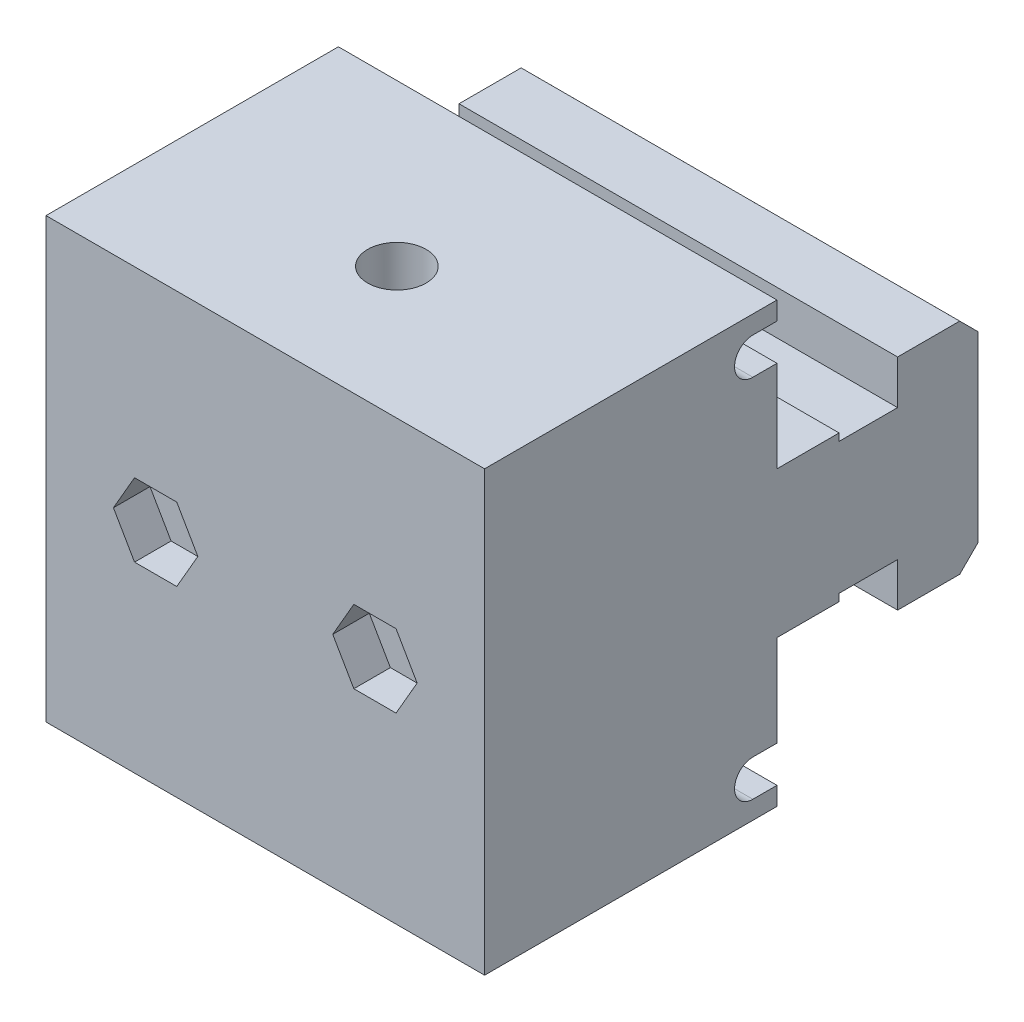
ISO-10303-21;
HEADER;
FILE_DESCRIPTION(('STEP AP214'),'2;1');
FILE_NAME('part.step','',(''),(''),'','','');
FILE_SCHEMA(('AUTOMOTIVE_DESIGN { 1 0 10303 214 1 1 1 1 }'));
ENDSEC;
DATA;
#1=APPLICATION_CONTEXT('core data for automotive mechanical design processes');
#2=APPLICATION_PROTOCOL_DEFINITION('international standard','automotive_design',2000,#1);
#3=PRODUCT_CONTEXT('',#1,'mechanical');
#4=PRODUCT('Part','Part','',(#3));
#5=PRODUCT_RELATED_PRODUCT_CATEGORY('part','',(#4));
#6=PRODUCT_DEFINITION_FORMATION('','',#4);
#7=PRODUCT_DEFINITION_CONTEXT('part definition',#1,'design');
#8=PRODUCT_DEFINITION('design','',#6,#7);
#9=PRODUCT_DEFINITION_SHAPE('','',#8);
#10=(LENGTH_UNIT() NAMED_UNIT(*) SI_UNIT(.MILLI.,.METRE.));
#11=(NAMED_UNIT(*) PLANE_ANGLE_UNIT() SI_UNIT($,.RADIAN.));
#12=(NAMED_UNIT(*) SI_UNIT($,.STERADIAN.) SOLID_ANGLE_UNIT());
#13=UNCERTAINTY_MEASURE_WITH_UNIT(LENGTH_MEASURE(1.E-05),#10,'distance_accuracy_value','');
#14=(GEOMETRIC_REPRESENTATION_CONTEXT(3) GLOBAL_UNCERTAINTY_ASSIGNED_CONTEXT((#13)) GLOBAL_UNIT_ASSIGNED_CONTEXT((#10,
#11,#12)) REPRESENTATION_CONTEXT('',''));
#15=CARTESIAN_POINT('',(0.,0.,0.));
#16=DIRECTION('',(0.,0.,1.));
#17=DIRECTION('',(1.,0.,0.));
#18=AXIS2_PLACEMENT_3D('',#15,#16,#17);
#19=CARTESIAN_POINT('',(60.,9.99922625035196,0.));
#20=DIRECTION('',(0.,0.,1.));
#21=DIRECTION('',(0.,-1.,0.));
#22=AXIS2_PLACEMENT_3D('',#19,#20,#21);
#23=PLANE('',#22);
#24=DIRECTION('',(0.,1.,0.));
#25=VECTOR('',#24,1.);
#26=CARTESIAN_POINT('',(0.,9.99922625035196,0.));
#27=LINE('',#26,#25);
#28=CARTESIAN_POINT('',(0.,27.4990625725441,0.));
#29=VERTEX_POINT('',#28);
#30=CARTESIAN_POINT('',(0.,30.,0.));
#31=VERTEX_POINT('',#30);
#32=EDGE_CURVE('E314',#29,#31,#27,.T.);
#33=ORIENTED_EDGE('',*,*,#32,.T.);
#34=DIRECTION('',(1.,0.,0.));
#35=VECTOR('',#34,1.);
#36=CARTESIAN_POINT('',(60.,30.,0.));
#37=LINE('',#36,#35);
#38=CARTESIAN_POINT('',(60.,30.,0.));
#39=VERTEX_POINT('',#38);
#40=EDGE_CURVE('E39',#31,#39,#37,.T.);
#41=ORIENTED_EDGE('',*,*,#40,.T.);
#42=DIRECTION('',(0.,1.,0.));
#43=VECTOR('',#42,1.);
#44=CARTESIAN_POINT('',(60.,9.99922625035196,0.));
#45=LINE('',#44,#43);
#46=CARTESIAN_POINT('',(60.,27.4990625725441,0.));
#47=VERTEX_POINT('',#46);
#48=EDGE_CURVE('E348',#47,#39,#45,.T.);
#49=ORIENTED_EDGE('',*,*,#48,.F.);
#50=DIRECTION('',(1.,0.,0.));
#51=VECTOR('',#50,1.);
#52=CARTESIAN_POINT('',(0.,27.4990625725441,0.));
#53=LINE('',#52,#51);
#54=EDGE_CURVE('E434',#29,#47,#53,.T.);
#55=ORIENTED_EDGE('',*,*,#54,.F.);
#56=EDGE_LOOP('',(#33,#41,#49,#55));
#57=FACE_BOUND('',#56,.T.);
#58=ADVANCED_FACE('F14',(#57),#23,.F.);
#59=CARTESIAN_POINT('',(60.,-30.0000595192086,0.));
#60=DIRECTION('',(0.,0.,1.));
#61=DIRECTION('',(1.,0.,0.));
#62=AXIS2_PLACEMENT_3D('',#59,#60,#61);
#63=PLANE('',#62);
#64=DIRECTION('',(0.,1.,0.));
#65=VECTOR('',#64,1.);
#66=CARTESIAN_POINT('',(60.,-30.0000595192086,0.));
#67=LINE('',#66,#65);
#68=CARTESIAN_POINT('',(60.,-22.5006398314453,0.));
#69=VERTEX_POINT('',#68);
#70=CARTESIAN_POINT('',(60.,-10.0004166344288,0.));
#71=VERTEX_POINT('',#70);
#72=EDGE_CURVE('E320',#69,#71,#67,.T.);
#73=ORIENTED_EDGE('',*,*,#72,.F.);
#74=DIRECTION('',(1.,0.,0.));
#75=VECTOR('',#74,1.);
#76=CARTESIAN_POINT('',(0.,-22.5006398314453,0.));
#77=LINE('',#76,#75);
#78=CARTESIAN_POINT('',(0.,-22.5006398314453,0.));
#79=VERTEX_POINT('',#78);
#80=EDGE_CURVE('E455',#79,#69,#77,.T.);
#81=ORIENTED_EDGE('',*,*,#80,.F.);
#82=DIRECTION('',(0.,1.,0.));
#83=VECTOR('',#82,1.);
#84=CARTESIAN_POINT('',(0.,-30.0000595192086,0.));
#85=LINE('',#84,#83);
#86=CARTESIAN_POINT('',(0.,-10.0004166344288,0.));
#87=VERTEX_POINT('',#86);
#88=EDGE_CURVE('E282',#79,#87,#85,.T.);
#89=ORIENTED_EDGE('',*,*,#88,.T.);
#90=DIRECTION('',(-1.,0.,0.));
#91=VECTOR('',#90,1.);
#92=CARTESIAN_POINT('',(60.,-10.0004166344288,0.));
#93=LINE('',#92,#91);
#94=EDGE_CURVE('E9',#71,#87,#93,.T.);
#95=ORIENTED_EDGE('',*,*,#94,.F.);
#96=EDGE_LOOP('',(#73,#81,#89,#95));
#97=FACE_BOUND('',#96,.T.);
#98=ADVANCED_FACE('F593',(#97),#63,.F.);
#99=CARTESIAN_POINT('',(60.,-30.,0.));
#100=VERTEX_POINT('',#99);
#101=CARTESIAN_POINT('',(60.,-27.5002529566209,0.));
#102=VERTEX_POINT('',#101);
#103=EDGE_CURVE('E275',#100,#102,#67,.T.);
#104=ORIENTED_EDGE('',*,*,#103,.F.);
#105=DIRECTION('',(-1.,0.,0.));
#106=VECTOR('',#105,1.);
#107=CARTESIAN_POINT('',(60.,-30.,0.));
#108=LINE('',#107,#106);
#109=CARTESIAN_POINT('',(0.,-30.,0.));
#110=VERTEX_POINT('',#109);
#111=EDGE_CURVE('E261',#100,#110,#108,.T.);
#112=ORIENTED_EDGE('',*,*,#111,.T.);
#113=CARTESIAN_POINT('',(0.,-27.5002529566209,0.));
#114=VERTEX_POINT('',#113);
#115=EDGE_CURVE('E273',#110,#114,#85,.T.);
#116=ORIENTED_EDGE('',*,*,#115,.T.);
#117=DIRECTION('',(1.,0.,0.));
#118=VECTOR('',#117,1.);
#119=CARTESIAN_POINT('',(0.,-27.5002529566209,0.));
#120=LINE('',#119,#118);
#121=EDGE_CURVE('E458',#114,#102,#120,.T.);
#122=ORIENTED_EDGE('',*,*,#121,.T.);
#123=EDGE_LOOP('',(#104,#112,#116,#122));
#124=FACE_BOUND('',#123,.T.);
#125=ADVANCED_FACE('F16',(#124),#63,.F.);
#126=CARTESIAN_POINT('',(60.,-10.0004166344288,-8.49934231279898));
#127=DIRECTION('',(0.,1.,0.));
#128=DIRECTION('',(-1.,0.,0.));
#129=AXIS2_PLACEMENT_3D('',#126,#127,#128);
#130=PLANE('',#129);
#131=DIRECTION('',(0.,0.,-1.));
#132=VECTOR('',#131,1.);
#133=CARTESIAN_POINT('',(0.,-10.0004166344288,-8.49934231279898));
#134=LINE('',#133,#132);
#135=CARTESIAN_POINT('',(0.,-10.0004166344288,-8.49934231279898));
#136=VERTEX_POINT('',#135);
#137=EDGE_CURVE('E281',#87,#136,#134,.T.);
#138=ORIENTED_EDGE('',*,*,#137,.T.);
#139=DIRECTION('',(-1.,0.,0.));
#140=VECTOR('',#139,1.);
#141=CARTESIAN_POINT('',(60.,-10.0004166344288,-8.49934231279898));
#142=LINE('',#141,#140);
#143=CARTESIAN_POINT('',(60.,-10.0004166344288,-8.49934231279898));
#144=VERTEX_POINT('',#143);
#145=EDGE_CURVE('E23',#144,#136,#142,.T.);
#146=ORIENTED_EDGE('',*,*,#145,.F.);
#147=DIRECTION('',(0.,0.,-1.));
#148=VECTOR('',#147,1.);
#149=CARTESIAN_POINT('',(60.,-10.0004166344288,-8.49934231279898));
#150=LINE('',#149,#148);
#151=EDGE_CURVE('E322',#71,#144,#150,.T.);
#152=ORIENTED_EDGE('',*,*,#151,.F.);
#153=ORIENTED_EDGE('',*,*,#94,.T.);
#154=EDGE_LOOP('',(#138,#146,#152,#153));
#155=FACE_BOUND('',#154,.T.);
#156=ADVANCED_FACE('F688',(#155),#130,.F.);
#157=CARTESIAN_POINT('',(60.,-9.00049400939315,-8.49934231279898));
#158=DIRECTION('',(0.,0.,1.));
#159=DIRECTION('',(1.,0.,0.));
#160=AXIS2_PLACEMENT_3D('',#157,#158,#159);
#161=PLANE('',#160);
#162=DIRECTION('',(0.,1.,0.));
#163=VECTOR('',#162,1.);
#164=CARTESIAN_POINT('',(0.,-9.00049400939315,-8.49934231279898));
#165=LINE('',#164,#163);
#166=CARTESIAN_POINT('',(0.,-9.00049400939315,-8.49934231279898));
#167=VERTEX_POINT('',#166);
#168=EDGE_CURVE('E284',#136,#167,#165,.T.);
#169=ORIENTED_EDGE('',*,*,#168,.T.);
#170=DIRECTION('',(-1.,0.,0.));
#171=VECTOR('',#170,1.);
#172=CARTESIAN_POINT('',(60.,-9.00049400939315,-8.49934231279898));
#173=LINE('',#172,#171);
#174=CARTESIAN_POINT('',(60.,-9.00049400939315,-8.49934231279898));
#175=VERTEX_POINT('',#174);
#176=EDGE_CURVE('E388',#175,#167,#173,.T.);
#177=ORIENTED_EDGE('',*,*,#176,.F.);
#178=DIRECTION('',(0.,1.,0.));
#179=VECTOR('',#178,1.);
#180=CARTESIAN_POINT('',(60.,-9.00049400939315,-8.49934231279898));
#181=LINE('',#180,#179);
#182=EDGE_CURVE('E324',#144,#175,#181,.T.);
#183=ORIENTED_EDGE('',*,*,#182,.F.);
#184=ORIENTED_EDGE('',*,*,#145,.T.);
#185=EDGE_LOOP('',(#169,#177,#183,#184));
#186=FACE_BOUND('',#185,.T.);
#187=ADVANCED_FACE('F683',(#186),#161,.F.);
#188=CARTESIAN_POINT('',(60.,-9.00049400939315,-8.49934231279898));
#189=DIRECTION('',(0.,1.,0.));
#190=DIRECTION('',(-1.,0.,0.));
#191=AXIS2_PLACEMENT_3D('',#188,#189,#190);
#192=PLANE('',#191);
#193=DIRECTION('',(0.,0.,-1.));
#194=VECTOR('',#193,1.);
#195=CARTESIAN_POINT('',(0.,-9.00049400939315,-8.49934231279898));
#196=LINE('',#195,#194);
#197=CARTESIAN_POINT('',(0.,-9.00049400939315,-16.4999136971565));
#198=VERTEX_POINT('',#197);
#199=EDGE_CURVE('E292',#167,#198,#196,.T.);
#200=ORIENTED_EDGE('',*,*,#199,.T.);
#201=DIRECTION('',(-1.,0.,0.));
#202=VECTOR('',#201,1.);
#203=CARTESIAN_POINT('',(60.,-9.00049400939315,-16.4999136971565));
#204=LINE('',#203,#202);
#205=CARTESIAN_POINT('',(60.,-9.00049400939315,-16.4999136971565));
#206=VERTEX_POINT('',#205);
#207=EDGE_CURVE('E385',#206,#198,#204,.T.);
#208=ORIENTED_EDGE('',*,*,#207,.F.);
#209=DIRECTION('',(0.,0.,-1.));
#210=VECTOR('',#209,1.);
#211=CARTESIAN_POINT('',(60.,-9.00049400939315,-8.49934231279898));
#212=LINE('',#211,#210);
#213=EDGE_CURVE('E326',#175,#206,#212,.T.);
#214=ORIENTED_EDGE('',*,*,#213,.F.);
#215=ORIENTED_EDGE('',*,*,#176,.T.);
#216=EDGE_LOOP('',(#200,#208,#214,#215));
#217=FACE_BOUND('',#216,.T.);
#218=ADVANCED_FACE('F677',(#217),#192,.F.);
#219=CARTESIAN_POINT('',(60.,-15.0000297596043,-16.4999136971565));
#220=DIRECTION('',(0.,0.,-1.));
#221=DIRECTION('',(-1.,0.,0.));
#222=AXIS2_PLACEMENT_3D('',#219,#220,#221);
#223=PLANE('',#222);
#224=DIRECTION('',(0.,-1.,0.));
#225=VECTOR('',#224,1.);
#226=CARTESIAN_POINT('',(0.,-15.0000297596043,-16.4999136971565));
#227=LINE('',#226,#225);
#228=CARTESIAN_POINT('',(0.,-15.0000297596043,-16.4999136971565));
#229=VERTEX_POINT('',#228);
#230=EDGE_CURVE('E294',#198,#229,#227,.T.);
#231=ORIENTED_EDGE('',*,*,#230,.T.);
#232=DIRECTION('',(-1.,0.,0.));
#233=VECTOR('',#232,1.);
#234=CARTESIAN_POINT('',(60.,-15.0000297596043,-16.4999136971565));
#235=LINE('',#234,#233);
#236=CARTESIAN_POINT('',(60.,-15.0000297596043,-16.4999136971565));
#237=VERTEX_POINT('',#236);
#238=EDGE_CURVE('E382',#237,#229,#235,.T.);
#239=ORIENTED_EDGE('',*,*,#238,.F.);
#240=DIRECTION('',(0.,-1.,0.));
#241=VECTOR('',#240,1.);
#242=CARTESIAN_POINT('',(60.,-15.0000297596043,-16.4999136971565));
#243=LINE('',#242,#241);
#244=EDGE_CURVE('E328',#206,#237,#243,.T.);
#245=ORIENTED_EDGE('',*,*,#244,.F.);
#246=ORIENTED_EDGE('',*,*,#207,.T.);
#247=EDGE_LOOP('',(#231,#239,#245,#246));
#248=FACE_BOUND('',#247,.T.);
#249=ADVANCED_FACE('F673',(#248),#223,.F.);
#250=CARTESIAN_POINT('',(60.,-15.0000297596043,-24.9992560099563));
#251=DIRECTION('',(0.,1.,0.));
#252=DIRECTION('',(-1.,0.,0.));
#253=AXIS2_PLACEMENT_3D('',#250,#251,#252);
#254=PLANE('',#253);
#255=DIRECTION('',(0.,0.,-1.));
#256=VECTOR('',#255,1.);
#257=CARTESIAN_POINT('',(0.,-15.0000297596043,-24.9992560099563));
#258=LINE('',#257,#256);
#259=CARTESIAN_POINT('',(0.,-15.0000297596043,-24.9992560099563));
#260=VERTEX_POINT('',#259);
#261=EDGE_CURVE('E296',#229,#260,#258,.T.);
#262=ORIENTED_EDGE('',*,*,#261,.T.);
#263=DIRECTION('',(-1.,0.,0.));
#264=VECTOR('',#263,1.);
#265=CARTESIAN_POINT('',(60.,-15.0000297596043,-24.9992560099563));
#266=LINE('',#265,#264);
#267=CARTESIAN_POINT('',(60.,-15.0000297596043,-24.9992560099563));
#268=VERTEX_POINT('',#267);
#269=EDGE_CURVE('E379',#268,#260,#266,.T.);
#270=ORIENTED_EDGE('',*,*,#269,.F.);
#271=DIRECTION('',(0.,0.,-1.));
#272=VECTOR('',#271,1.);
#273=CARTESIAN_POINT('',(60.,-15.0000297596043,-24.9992560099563));
#274=LINE('',#273,#272);
#275=EDGE_CURVE('E330',#237,#268,#274,.T.);
#276=ORIENTED_EDGE('',*,*,#275,.F.);
#277=ORIENTED_EDGE('',*,*,#238,.T.);
#278=EDGE_LOOP('',(#262,#270,#276,#277));
#279=FACE_BOUND('',#278,.T.);
#280=ADVANCED_FACE('F668',(#279),#254,.F.);
#281=CARTESIAN_POINT('',(60.,-12.5002231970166,-27.500252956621));
#282=DIRECTION('',(0.,0.707275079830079,0.706938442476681));
#283=DIRECTION('',(0.,-0.706938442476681,0.707275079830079));
#284=AXIS2_PLACEMENT_3D('',#281,#282,#283);
#285=PLANE('',#284);
#286=DIRECTION('',(0.,0.706938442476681,-0.707275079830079));
#287=VECTOR('',#286,1.);
#288=CARTESIAN_POINT('',(0.,-12.5002231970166,-27.500252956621));
#289=LINE('',#288,#287);
#290=CARTESIAN_POINT('',(0.,-12.5002231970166,-27.500252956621));
#291=VERTEX_POINT('',#290);
#292=EDGE_CURVE('E298',#260,#291,#289,.T.);
#293=ORIENTED_EDGE('',*,*,#292,.T.);
#294=DIRECTION('',(-1.,0.,0.));
#295=VECTOR('',#294,1.);
#296=CARTESIAN_POINT('',(60.,-12.5002231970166,-27.500252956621));
#297=LINE('',#296,#295);
#298=CARTESIAN_POINT('',(60.,-12.5002231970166,-27.500252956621));
#299=VERTEX_POINT('',#298);
#300=EDGE_CURVE('E376',#299,#291,#297,.T.);
#301=ORIENTED_EDGE('',*,*,#300,.F.);
#302=DIRECTION('',(0.,0.706938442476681,-0.707275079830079));
#303=VECTOR('',#302,1.);
#304=CARTESIAN_POINT('',(60.,-12.5002231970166,-27.500252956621));
#305=LINE('',#304,#303);
#306=EDGE_CURVE('E332',#268,#299,#305,.T.);
#307=ORIENTED_EDGE('',*,*,#306,.F.);
#308=ORIENTED_EDGE('',*,*,#269,.T.);
#309=EDGE_LOOP('',(#293,#301,#307,#308));
#310=FACE_BOUND('',#309,.T.);
#311=ADVANCED_FACE('F662',(#310),#285,.F.);
#312=CARTESIAN_POINT('',(60.,12.5002231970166,-27.500252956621));
#313=DIRECTION('',(0.,0.,1.));
#314=DIRECTION('',(1.,0.,0.));
#315=AXIS2_PLACEMENT_3D('',#312,#313,#314);
#316=PLANE('',#315);
#317=DIRECTION('',(0.,1.,0.));
#318=VECTOR('',#317,1.);
#319=CARTESIAN_POINT('',(0.,12.5002231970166,-27.500252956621));
#320=LINE('',#319,#318);
#321=CARTESIAN_POINT('',(0.,12.5002231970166,-27.500252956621));
#322=VERTEX_POINT('',#321);
#323=EDGE_CURVE('E300',#291,#322,#320,.T.);
#324=ORIENTED_EDGE('',*,*,#323,.T.);
#325=DIRECTION('',(-1.,0.,0.));
#326=VECTOR('',#325,1.);
#327=CARTESIAN_POINT('',(60.,12.5002231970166,-27.500252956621));
#328=LINE('',#327,#326);
#329=CARTESIAN_POINT('',(60.,12.5002231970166,-27.500252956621));
#330=VERTEX_POINT('',#329);
#331=EDGE_CURVE('E373',#330,#322,#328,.T.);
#332=ORIENTED_EDGE('',*,*,#331,.F.);
#333=DIRECTION('',(0.,1.,0.));
#334=VECTOR('',#333,1.);
#335=CARTESIAN_POINT('',(60.,12.5002231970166,-27.500252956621));
#336=LINE('',#335,#334);
#337=EDGE_CURVE('E334',#299,#330,#336,.T.);
#338=ORIENTED_EDGE('',*,*,#337,.F.);
#339=ORIENTED_EDGE('',*,*,#300,.T.);
#340=EDGE_LOOP('',(#324,#332,#338,#339));
#341=FACE_BOUND('',#340,.T.);
#342=ADVANCED_FACE('F658',(#341),#316,.F.);
#343=CARTESIAN_POINT('',(60.,15.0000297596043,-24.9992560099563));
#344=DIRECTION('',(0.,-0.707275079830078,0.706938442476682));
#345=DIRECTION('',(0.,-0.706938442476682,-0.707275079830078));
#346=AXIS2_PLACEMENT_3D('',#343,#344,#345);
#347=PLANE('',#346);
#348=DIRECTION('',(0.,0.706938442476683,0.707275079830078));
#349=VECTOR('',#348,1.);
#350=CARTESIAN_POINT('',(0.,15.0000297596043,-24.9992560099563));
#351=LINE('',#350,#349);
#352=CARTESIAN_POINT('',(0.,15.0000297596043,-24.9992560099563));
#353=VERTEX_POINT('',#352);
#354=EDGE_CURVE('E302',#322,#353,#351,.T.);
#355=ORIENTED_EDGE('',*,*,#354,.T.);
#356=DIRECTION('',(-1.,0.,0.));
#357=VECTOR('',#356,1.);
#358=CARTESIAN_POINT('',(60.,15.0000297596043,-24.9992560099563));
#359=LINE('',#358,#357);
#360=CARTESIAN_POINT('',(60.,15.0000297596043,-24.9992560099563));
#361=VERTEX_POINT('',#360);
#362=EDGE_CURVE('E370',#361,#353,#359,.T.);
#363=ORIENTED_EDGE('',*,*,#362,.F.);
#364=DIRECTION('',(0.,0.706938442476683,0.707275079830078));
#365=VECTOR('',#364,1.);
#366=CARTESIAN_POINT('',(60.,15.0000297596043,-24.9992560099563));
#367=LINE('',#366,#365);
#368=EDGE_CURVE('E336',#330,#361,#367,.T.);
#369=ORIENTED_EDGE('',*,*,#368,.F.);
#370=ORIENTED_EDGE('',*,*,#331,.T.);
#371=EDGE_LOOP('',(#355,#363,#369,#370));
#372=FACE_BOUND('',#371,.T.);
#373=ADVANCED_FACE('F653',(#372),#347,.F.);
#374=CARTESIAN_POINT('',(60.,15.0000297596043,-16.4999136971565));
#375=DIRECTION('',(0.,-1.,0.));
#376=DIRECTION('',(1.,0.,0.));
#377=AXIS2_PLACEMENT_3D('',#374,#375,#376);
#378=PLANE('',#377);
#379=DIRECTION('',(0.,0.,1.));
#380=VECTOR('',#379,1.);
#381=CARTESIAN_POINT('',(0.,15.0000297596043,-16.4999136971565));
#382=LINE('',#381,#380);
#383=CARTESIAN_POINT('',(0.,15.0000297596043,-16.4999136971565));
#384=VERTEX_POINT('',#383);
#385=EDGE_CURVE('E304',#353,#384,#382,.T.);
#386=ORIENTED_EDGE('',*,*,#385,.T.);
#387=DIRECTION('',(-1.,0.,0.));
#388=VECTOR('',#387,1.);
#389=CARTESIAN_POINT('',(60.,15.0000297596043,-16.4999136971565));
#390=LINE('',#389,#388);
#391=CARTESIAN_POINT('',(60.,15.0000297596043,-16.4999136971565));
#392=VERTEX_POINT('',#391);
#393=EDGE_CURVE('E367',#392,#384,#390,.T.);
#394=ORIENTED_EDGE('',*,*,#393,.F.);
#395=DIRECTION('',(0.,0.,1.));
#396=VECTOR('',#395,1.);
#397=CARTESIAN_POINT('',(60.,15.0000297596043,-16.4999136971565));
#398=LINE('',#397,#396);
#399=EDGE_CURVE('E338',#361,#392,#398,.T.);
#400=ORIENTED_EDGE('',*,*,#399,.F.);
#401=ORIENTED_EDGE('',*,*,#362,.T.);
#402=EDGE_LOOP('',(#386,#394,#400,#401));
#403=FACE_BOUND('',#402,.T.);
#404=ADVANCED_FACE('F647',(#403),#378,.F.);
#405=CARTESIAN_POINT('',(60.,8.99930362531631,-16.4999136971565));
#406=DIRECTION('',(0.,0.,-1.));
#407=DIRECTION('',(-1.,0.,0.));
#408=AXIS2_PLACEMENT_3D('',#405,#406,#407);
#409=PLANE('',#408);
#410=DIRECTION('',(0.,-1.,0.));
#411=VECTOR('',#410,1.);
#412=CARTESIAN_POINT('',(0.,8.99930362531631,-16.4999136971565));
#413=LINE('',#412,#411);
#414=CARTESIAN_POINT('',(0.,8.99930362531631,-16.4999136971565));
#415=VERTEX_POINT('',#414);
#416=EDGE_CURVE('E306',#384,#415,#413,.T.);
#417=ORIENTED_EDGE('',*,*,#416,.T.);
#418=DIRECTION('',(-1.,0.,0.));
#419=VECTOR('',#418,1.);
#420=CARTESIAN_POINT('',(60.,8.99930362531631,-16.4999136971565));
#421=LINE('',#420,#419);
#422=CARTESIAN_POINT('',(60.,8.99930362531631,-16.4999136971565));
#423=VERTEX_POINT('',#422);
#424=EDGE_CURVE('E364',#423,#415,#421,.T.);
#425=ORIENTED_EDGE('',*,*,#424,.F.);
#426=DIRECTION('',(0.,-1.,0.));
#427=VECTOR('',#426,1.);
#428=CARTESIAN_POINT('',(60.,8.99930362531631,-16.4999136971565));
#429=LINE('',#428,#427);
#430=EDGE_CURVE('E340',#392,#423,#429,.T.);
#431=ORIENTED_EDGE('',*,*,#430,.F.);
#432=ORIENTED_EDGE('',*,*,#393,.T.);
#433=EDGE_LOOP('',(#417,#425,#431,#432));
#434=FACE_BOUND('',#433,.T.);
#435=ADVANCED_FACE('F643',(#434),#409,.F.);
#436=CARTESIAN_POINT('',(60.,8.99930362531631,-16.4999136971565));
#437=DIRECTION('',(0.,-1.,0.));
#438=DIRECTION('',(1.,0.,0.));
#439=AXIS2_PLACEMENT_3D('',#436,#437,#438);
#440=PLANE('',#439);
#441=DIRECTION('',(0.,0.,1.));
#442=VECTOR('',#441,1.);
#443=CARTESIAN_POINT('',(0.,8.99930362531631,-16.4999136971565));
#444=LINE('',#443,#442);
#445=CARTESIAN_POINT('',(0.,8.99930362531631,-8.49934231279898));
#446=VERTEX_POINT('',#445);
#447=EDGE_CURVE('E308',#415,#446,#444,.T.);
#448=ORIENTED_EDGE('',*,*,#447,.T.);
#449=DIRECTION('',(-1.,0.,0.));
#450=VECTOR('',#449,1.);
#451=CARTESIAN_POINT('',(60.,8.99930362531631,-8.49934231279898));
#452=LINE('',#451,#450);
#453=CARTESIAN_POINT('',(60.,8.99930362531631,-8.49934231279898));
#454=VERTEX_POINT('',#453);
#455=EDGE_CURVE('E361',#454,#446,#452,.T.);
#456=ORIENTED_EDGE('',*,*,#455,.F.);
#457=DIRECTION('',(0.,0.,1.));
#458=VECTOR('',#457,1.);
#459=CARTESIAN_POINT('',(60.,8.99930362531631,-16.4999136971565));
#460=LINE('',#459,#458);
#461=EDGE_CURVE('E342',#423,#454,#460,.T.);
#462=ORIENTED_EDGE('',*,*,#461,.F.);
#463=ORIENTED_EDGE('',*,*,#424,.T.);
#464=EDGE_LOOP('',(#448,#456,#462,#463));
#465=FACE_BOUND('',#464,.T.);
#466=ADVANCED_FACE('F638',(#465),#440,.F.);
#467=CARTESIAN_POINT('',(60.,9.99922625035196,-8.49934231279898));
#468=DIRECTION('',(0.,0.,1.));
#469=DIRECTION('',(1.,0.,0.));
#470=AXIS2_PLACEMENT_3D('',#467,#468,#469);
#471=PLANE('',#470);
#472=DIRECTION('',(0.,1.,0.));
#473=VECTOR('',#472,1.);
#474=CARTESIAN_POINT('',(0.,9.99922625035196,-8.49934231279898));
#475=LINE('',#474,#473);
#476=CARTESIAN_POINT('',(0.,9.99922625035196,-8.49934231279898));
#477=VERTEX_POINT('',#476);
#478=EDGE_CURVE('E310',#446,#477,#475,.T.);
#479=ORIENTED_EDGE('',*,*,#478,.T.);
#480=DIRECTION('',(-1.,0.,0.));
#481=VECTOR('',#480,1.);
#482=CARTESIAN_POINT('',(60.,9.99922625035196,-8.49934231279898));
#483=LINE('',#482,#481);
#484=CARTESIAN_POINT('',(60.,9.99922625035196,-8.49934231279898));
#485=VERTEX_POINT('',#484);
#486=EDGE_CURVE('E358',#485,#477,#483,.T.);
#487=ORIENTED_EDGE('',*,*,#486,.F.);
#488=DIRECTION('',(0.,1.,0.));
#489=VECTOR('',#488,1.);
#490=CARTESIAN_POINT('',(60.,9.99922625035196,-8.49934231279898));
#491=LINE('',#490,#489);
#492=EDGE_CURVE('E344',#454,#485,#491,.T.);
#493=ORIENTED_EDGE('',*,*,#492,.F.);
#494=ORIENTED_EDGE('',*,*,#455,.T.);
#495=EDGE_LOOP('',(#479,#487,#493,#494));
#496=FACE_BOUND('',#495,.T.);
#497=ADVANCED_FACE('F615',(#496),#471,.F.);
#498=CARTESIAN_POINT('',(60.,9.99922625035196,0.));
#499=DIRECTION('',(0.,-1.,0.));
#500=DIRECTION('',(1.,0.,0.));
#501=AXIS2_PLACEMENT_3D('',#498,#499,#500);
#502=PLANE('',#501);
#503=DIRECTION('',(0.,0.,1.));
#504=VECTOR('',#503,1.);
#505=CARTESIAN_POINT('',(0.,9.99922625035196,0.));
#506=LINE('',#505,#504);
#507=CARTESIAN_POINT('',(0.,9.99922625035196,0.));
#508=VERTEX_POINT('',#507);
#509=EDGE_CURVE('E312',#477,#508,#506,.T.);
#510=ORIENTED_EDGE('',*,*,#509,.T.);
#511=DIRECTION('',(-1.,0.,0.));
#512=VECTOR('',#511,1.);
#513=CARTESIAN_POINT('',(60.,9.99922625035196,0.));
#514=LINE('',#513,#512);
#515=CARTESIAN_POINT('',(60.,9.99922625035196,0.));
#516=VERTEX_POINT('',#515);
#517=EDGE_CURVE('E355',#516,#508,#514,.T.);
#518=ORIENTED_EDGE('',*,*,#517,.F.);
#519=DIRECTION('',(0.,0.,1.));
#520=VECTOR('',#519,1.);
#521=CARTESIAN_POINT('',(60.,9.99922625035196,0.));
#522=LINE('',#521,#520);
#523=EDGE_CURVE('E346',#485,#516,#522,.T.);
#524=ORIENTED_EDGE('',*,*,#523,.F.);
#525=ORIENTED_EDGE('',*,*,#486,.T.);
#526=EDGE_LOOP('',(#510,#518,#524,#525));
#527=FACE_BOUND('',#526,.T.);
#528=ADVANCED_FACE('F606',(#527),#502,.F.);
#529=CARTESIAN_POINT('',(0.,22.4994494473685,0.));
#530=VERTEX_POINT('',#529);
#531=EDGE_CURVE('E315',#508,#530,#27,.T.);
#532=ORIENTED_EDGE('',*,*,#531,.T.);
#533=DIRECTION('',(1.,0.,0.));
#534=VECTOR('',#533,1.);
#535=CARTESIAN_POINT('',(0.,22.4994494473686,0.));
#536=LINE('',#535,#534);
#537=CARTESIAN_POINT('',(60.,22.4994494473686,0.));
#538=VERTEX_POINT('',#537);
#539=EDGE_CURVE('E436',#530,#538,#536,.T.);
#540=ORIENTED_EDGE('',*,*,#539,.T.);
#541=EDGE_CURVE('E349',#516,#538,#45,.T.);
#542=ORIENTED_EDGE('',*,*,#541,.F.);
#543=ORIENTED_EDGE('',*,*,#517,.T.);
#544=EDGE_LOOP('',(#532,#540,#542,#543));
#545=FACE_BOUND('',#544,.T.);
#546=ADVANCED_FACE('F596',(#545),#23,.F.);
#547=CARTESIAN_POINT('',(60.,30.0000595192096,40.));
#548=DIRECTION('',(0.,0.,-1.));
#549=DIRECTION('',(-1.,0.,0.));
#550=AXIS2_PLACEMENT_3D('',#547,#548,#549);
#551=PLANE('',#550);
#552=DIRECTION('',(0.5,-0.866025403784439,0.));
#553=VECTOR('',#552,1.);
#554=CARTESIAN_POINT('',(39.2264973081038,0.,40.));
#555=LINE('',#554,#553);
#556=CARTESIAN_POINT('',(39.2264973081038,0.,40.));
#557=VERTEX_POINT('',#556);
#558=CARTESIAN_POINT('',(42.1132486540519,-5.,40.));
#559=VERTEX_POINT('',#558);
#560=EDGE_CURVE('E464',#557,#559,#555,.T.);
#561=ORIENTED_EDGE('',*,*,#560,.F.);
#562=DIRECTION('',(-0.5,-0.866025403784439,0.));
#563=VECTOR('',#562,1.);
#564=CARTESIAN_POINT('',(42.1132486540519,5.,40.));
#565=LINE('',#564,#563);
#566=CARTESIAN_POINT('',(42.1132486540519,5.,40.));
#567=VERTEX_POINT('',#566);
#568=EDGE_CURVE('E457',#567,#557,#565,.T.);
#569=ORIENTED_EDGE('',*,*,#568,.F.);
#570=DIRECTION('',(-1.,0.,0.));
#571=VECTOR('',#570,1.);
#572=CARTESIAN_POINT('',(47.8867513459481,5.,40.));
#573=LINE('',#572,#571);
#574=CARTESIAN_POINT('',(47.8867513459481,5.,40.));
#575=VERTEX_POINT('',#574);
#576=EDGE_CURVE('E476',#575,#567,#573,.T.);
#577=ORIENTED_EDGE('',*,*,#576,.F.);
#578=DIRECTION('',(-0.5,0.866025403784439,0.));
#579=VECTOR('',#578,1.);
#580=CARTESIAN_POINT('',(50.7735026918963,0.,40.));
#581=LINE('',#580,#579);
#582=CARTESIAN_POINT('',(50.7735026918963,0.,40.));
#583=VERTEX_POINT('',#582);
#584=EDGE_CURVE('E473',#583,#575,#581,.T.);
#585=ORIENTED_EDGE('',*,*,#584,.F.);
#586=DIRECTION('',(0.5,0.866025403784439,0.));
#587=VECTOR('',#586,1.);
#588=CARTESIAN_POINT('',(47.8867513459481,-5.,40.));
#589=LINE('',#588,#587);
#590=CARTESIAN_POINT('',(47.8867513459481,-5.,40.));
#591=VERTEX_POINT('',#590);
#592=EDGE_CURVE('E470',#591,#583,#589,.T.);
#593=ORIENTED_EDGE('',*,*,#592,.F.);
#594=DIRECTION('',(1.,0.,0.));
#595=VECTOR('',#594,1.);
#596=CARTESIAN_POINT('',(42.1132486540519,-5.,40.));
#597=LINE('',#596,#595);
#598=EDGE_CURVE('E467',#559,#591,#597,.T.);
#599=ORIENTED_EDGE('',*,*,#598,.F.);
#600=EDGE_LOOP('',(#561,#569,#577,#585,#593,#599));
#601=FACE_BOUND('',#600,.T.);
#602=DIRECTION('',(0.5,-0.866025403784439,0.));
#603=VECTOR('',#602,1.);
#604=CARTESIAN_POINT('',(9.22649730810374,0.,40.));
#605=LINE('',#604,#603);
#606=CARTESIAN_POINT('',(9.22649730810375,0.,40.));
#607=VERTEX_POINT('',#606);
#608=CARTESIAN_POINT('',(12.1132486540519,-5.,40.));
#609=VERTEX_POINT('',#608);
#610=EDGE_CURVE('E512',#607,#609,#605,.T.);
#611=ORIENTED_EDGE('',*,*,#610,.F.);
#612=DIRECTION('',(-0.5,-0.866025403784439,0.));
#613=VECTOR('',#612,1.);
#614=CARTESIAN_POINT('',(12.1132486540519,5.,40.));
#615=LINE('',#614,#613);
#616=CARTESIAN_POINT('',(12.1132486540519,5.,40.));
#617=VERTEX_POINT('',#616);
#618=EDGE_CURVE('E500',#617,#607,#615,.T.);
#619=ORIENTED_EDGE('',*,*,#618,.F.);
#620=DIRECTION('',(-1.,0.,0.));
#621=VECTOR('',#620,1.);
#622=CARTESIAN_POINT('',(17.8867513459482,5.,40.));
#623=LINE('',#622,#621);
#624=CARTESIAN_POINT('',(17.8867513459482,5.,40.));
#625=VERTEX_POINT('',#624);
#626=EDGE_CURVE('E524',#625,#617,#623,.T.);
#627=ORIENTED_EDGE('',*,*,#626,.F.);
#628=DIRECTION('',(-0.5,0.866025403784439,0.));
#629=VECTOR('',#628,1.);
#630=CARTESIAN_POINT('',(20.7735026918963,0.,40.));
#631=LINE('',#630,#629);
#632=CARTESIAN_POINT('',(20.7735026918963,0.,40.));
#633=VERTEX_POINT('',#632);
#634=EDGE_CURVE('E521',#633,#625,#631,.T.);
#635=ORIENTED_EDGE('',*,*,#634,.F.);
#636=DIRECTION('',(0.5,0.866025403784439,0.));
#637=VECTOR('',#636,1.);
#638=CARTESIAN_POINT('',(17.8867513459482,-5.,40.));
#639=LINE('',#638,#637);
#640=CARTESIAN_POINT('',(17.8867513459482,-5.,40.));
#641=VERTEX_POINT('',#640);
#642=EDGE_CURVE('E518',#641,#633,#639,.T.);
#643=ORIENTED_EDGE('',*,*,#642,.F.);
#644=DIRECTION('',(1.,0.,0.));
#645=VECTOR('',#644,1.);
#646=CARTESIAN_POINT('',(12.1132486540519,-5.,40.));
#647=LINE('',#646,#645);
#648=EDGE_CURVE('E515',#609,#641,#647,.T.);
#649=ORIENTED_EDGE('',*,*,#648,.F.);
#650=EDGE_LOOP('',(#611,#619,#627,#635,#643,#649));
#651=FACE_BOUND('',#650,.T.);
#652=DIRECTION('',(0.,-1.,0.));
#653=VECTOR('',#652,1.);
#654=CARTESIAN_POINT('',(60.,30.0000595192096,40.));
#655=LINE('',#654,#653);
#656=CARTESIAN_POINT('',(60.,30.,40.));
#657=VERTEX_POINT('',#656);
#658=CARTESIAN_POINT('',(60.,-30.,40.));
#659=VERTEX_POINT('',#658);
#660=EDGE_CURVE('E352',#657,#659,#655,.T.);
#661=ORIENTED_EDGE('',*,*,#660,.F.);
#662=DIRECTION('',(-1.,0.,0.));
#663=VECTOR('',#662,1.);
#664=CARTESIAN_POINT('',(60.,30.,40.));
#665=LINE('',#664,#663);
#666=CARTESIAN_POINT('',(0.,30.,40.));
#667=VERTEX_POINT('',#666);
#668=EDGE_CURVE('E409',#657,#667,#665,.T.);
#669=ORIENTED_EDGE('',*,*,#668,.T.);
#670=DIRECTION('',(0.,-1.,0.));
#671=VECTOR('',#670,1.);
#672=CARTESIAN_POINT('',(0.,30.0000595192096,40.));
#673=LINE('',#672,#671);
#674=CARTESIAN_POINT('',(0.,-30.,40.));
#675=VERTEX_POINT('',#674);
#676=EDGE_CURVE('E318',#667,#675,#673,.T.);
#677=ORIENTED_EDGE('',*,*,#676,.T.);
#678=DIRECTION('',(1.,0.,0.));
#679=VECTOR('',#678,1.);
#680=CARTESIAN_POINT('',(60.,-30.,40.));
#681=LINE('',#680,#679);
#682=EDGE_CURVE('E31',#675,#659,#681,.T.);
#683=ORIENTED_EDGE('',*,*,#682,.T.);
#684=EDGE_LOOP('',(#661,#669,#677,#683));
#685=FACE_BOUND('',#684,.T.);
#686=ADVANCED_FACE('F564',(#601,#651,#685),#551,.F.);
#687=CARTESIAN_POINT('',(60.,-10.0004166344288,0.));
#688=DIRECTION('',(1.,0.,0.));
#689=DIRECTION('',(0.,1.,0.));
#690=AXIS2_PLACEMENT_3D('',#687,#688,#689);
#691=PLANE('',#690);
#692=DIRECTION('',(0.,0.,1.));
#693=VECTOR('',#692,1.);
#694=CARTESIAN_POINT('',(60.,30.,48.9184671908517));
#695=LINE('',#694,#693);
#696=EDGE_CURVE('E394',#39,#657,#695,.T.);
#697=ORIENTED_EDGE('',*,*,#696,.T.);
#698=ORIENTED_EDGE('',*,*,#660,.T.);
#699=DIRECTION('',(0.,0.,-1.));
#700=VECTOR('',#699,1.);
#701=CARTESIAN_POINT('',(60.,-30.,-13.6813245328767));
#702=LINE('',#701,#700);
#703=EDGE_CURVE('E267',#659,#100,#702,.T.);
#704=ORIENTED_EDGE('',*,*,#703,.T.);
#705=ORIENTED_EDGE('',*,*,#103,.T.);
#706=DIRECTION('',(0.,0.,-1.));
#707=VECTOR('',#706,1.);
#708=CARTESIAN_POINT('',(60.,-27.5002529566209,0.));
#709=LINE('',#708,#707);
#710=CARTESIAN_POINT('',(60.,-27.5002529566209,3.2997446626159));
#711=VERTEX_POINT('',#710);
#712=EDGE_CURVE('E445',#711,#102,#709,.T.);
#713=ORIENTED_EDGE('',*,*,#712,.F.);
#714=CARTESIAN_POINT('',(60.,-25.0004463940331,3.2997446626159));
#715=DIRECTION('',(1.,0.,0.));
#716=DIRECTION('',(0.,1.,0.));
#717=AXIS2_PLACEMENT_3D('',#714,#715,#716);
#718=CIRCLE('',#717,2.49980656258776);
#719=CARTESIAN_POINT('',(60.,-22.5006398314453,3.2997446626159));
#720=VERTEX_POINT('',#719);
#721=EDGE_CURVE('E442',#720,#711,#718,.T.);
#722=ORIENTED_EDGE('',*,*,#721,.F.);
#723=DIRECTION('',(0.,0.,1.));
#724=VECTOR('',#723,1.);
#725=CARTESIAN_POINT('',(60.,-22.5006398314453,0.));
#726=LINE('',#725,#724);
#727=EDGE_CURVE('E433',#69,#720,#726,.T.);
#728=ORIENTED_EDGE('',*,*,#727,.F.);
#729=ORIENTED_EDGE('',*,*,#72,.T.);
#730=ORIENTED_EDGE('',*,*,#151,.T.);
#731=ORIENTED_EDGE('',*,*,#182,.T.);
#732=ORIENTED_EDGE('',*,*,#213,.T.);
#733=ORIENTED_EDGE('',*,*,#244,.T.);
#734=ORIENTED_EDGE('',*,*,#275,.T.);
#735=ORIENTED_EDGE('',*,*,#306,.T.);
#736=ORIENTED_EDGE('',*,*,#337,.T.);
#737=ORIENTED_EDGE('',*,*,#368,.T.);
#738=ORIENTED_EDGE('',*,*,#399,.T.);
#739=ORIENTED_EDGE('',*,*,#430,.T.);
#740=ORIENTED_EDGE('',*,*,#461,.T.);
#741=ORIENTED_EDGE('',*,*,#492,.T.);
#742=ORIENTED_EDGE('',*,*,#523,.T.);
#743=ORIENTED_EDGE('',*,*,#541,.T.);
#744=DIRECTION('',(0.,0.,-1.));
#745=VECTOR('',#744,1.);
#746=CARTESIAN_POINT('',(60.,22.4994494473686,0.));
#747=LINE('',#746,#745);
#748=CARTESIAN_POINT('',(60.,22.4994494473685,3.2997446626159));
#749=VERTEX_POINT('',#748);
#750=EDGE_CURVE('E416',#749,#538,#747,.T.);
#751=ORIENTED_EDGE('',*,*,#750,.F.);
#752=CARTESIAN_POINT('',(60.,24.9992560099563,3.2997446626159));
#753=DIRECTION('',(1.,0.,0.));
#754=DIRECTION('',(0.,1.,0.));
#755=AXIS2_PLACEMENT_3D('',#752,#753,#754);
#756=CIRCLE('',#755,2.49980656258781);
#757=CARTESIAN_POINT('',(60.,27.4990625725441,3.2997446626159));
#758=VERTEX_POINT('',#757);
#759=EDGE_CURVE('E413',#758,#749,#756,.T.);
#760=ORIENTED_EDGE('',*,*,#759,.F.);
#761=DIRECTION('',(0.,0.,1.));
#762=VECTOR('',#761,1.);
#763=CARTESIAN_POINT('',(60.,27.4990625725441,0.));
#764=LINE('',#763,#762);
#765=EDGE_CURVE('E418',#47,#758,#764,.T.);
#766=ORIENTED_EDGE('',*,*,#765,.F.);
#767=ORIENTED_EDGE('',*,*,#48,.T.);
#768=EDGE_LOOP('',(#697,#698,#704,#705,#713,#722,#728,#729,#730,#731,#732,#733,#734,#735,#736,
#737,#738,#739,#740,#741,#742,#743,#751,#760,#766,#767));
#769=FACE_BOUND('',#768,.T.);
#770=ADVANCED_FACE('F613',(#769),#691,.T.);
#771=CARTESIAN_POINT('',(0.,-10.0004166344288,0.));
#772=DIRECTION('',(1.,0.,0.));
#773=DIRECTION('',(0.,1.,0.));
#774=AXIS2_PLACEMENT_3D('',#771,#772,#773);
#775=PLANE('',#774);
#776=ORIENTED_EDGE('',*,*,#676,.F.);
#777=DIRECTION('',(0.,0.,1.));
#778=VECTOR('',#777,1.);
#779=CARTESIAN_POINT('',(0.,30.,48.9184671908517));
#780=LINE('',#779,#778);
#781=EDGE_CURVE('E399',#31,#667,#780,.T.);
#782=ORIENTED_EDGE('',*,*,#781,.F.);
#783=ORIENTED_EDGE('',*,*,#32,.F.);
#784=DIRECTION('',(0.,0.,1.));
#785=VECTOR('',#784,1.);
#786=CARTESIAN_POINT('',(0.,27.4990625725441,0.));
#787=LINE('',#786,#785);
#788=CARTESIAN_POINT('',(0.,27.4990625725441,3.2997446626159));
#789=VERTEX_POINT('',#788);
#790=EDGE_CURVE('E427',#29,#789,#787,.T.);
#791=ORIENTED_EDGE('',*,*,#790,.T.);
#792=CARTESIAN_POINT('',(0.,24.9992560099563,3.2997446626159));
#793=DIRECTION('',(1.,0.,0.));
#794=DIRECTION('',(0.,1.,0.));
#795=AXIS2_PLACEMENT_3D('',#792,#793,#794);
#796=CIRCLE('',#795,2.49980656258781);
#797=CARTESIAN_POINT('',(0.,22.4994494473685,3.2997446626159));
#798=VERTEX_POINT('',#797);
#799=EDGE_CURVE('E421',#789,#798,#796,.T.);
#800=ORIENTED_EDGE('',*,*,#799,.T.);
#801=DIRECTION('',(0.,0.,-1.));
#802=VECTOR('',#801,1.);
#803=CARTESIAN_POINT('',(0.,22.4994494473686,0.));
#804=LINE('',#803,#802);
#805=EDGE_CURVE('E424',#798,#530,#804,.T.);
#806=ORIENTED_EDGE('',*,*,#805,.T.);
#807=ORIENTED_EDGE('',*,*,#531,.F.);
#808=ORIENTED_EDGE('',*,*,#509,.F.);
#809=ORIENTED_EDGE('',*,*,#478,.F.);
#810=ORIENTED_EDGE('',*,*,#447,.F.);
#811=ORIENTED_EDGE('',*,*,#416,.F.);
#812=ORIENTED_EDGE('',*,*,#385,.F.);
#813=ORIENTED_EDGE('',*,*,#354,.F.);
#814=ORIENTED_EDGE('',*,*,#323,.F.);
#815=ORIENTED_EDGE('',*,*,#292,.F.);
#816=ORIENTED_EDGE('',*,*,#261,.F.);
#817=ORIENTED_EDGE('',*,*,#230,.F.);
#818=ORIENTED_EDGE('',*,*,#199,.F.);
#819=ORIENTED_EDGE('',*,*,#168,.F.);
#820=ORIENTED_EDGE('',*,*,#137,.F.);
#821=ORIENTED_EDGE('',*,*,#88,.F.);
#822=DIRECTION('',(0.,0.,1.));
#823=VECTOR('',#822,1.);
#824=CARTESIAN_POINT('',(0.,-22.5006398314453,0.));
#825=LINE('',#824,#823);
#826=CARTESIAN_POINT('',(0.,-22.5006398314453,3.2997446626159));
#827=VERTEX_POINT('',#826);
#828=EDGE_CURVE('E448',#79,#827,#825,.T.);
#829=ORIENTED_EDGE('',*,*,#828,.T.);
#830=CARTESIAN_POINT('',(0.,-25.0004463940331,3.2997446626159));
#831=DIRECTION('',(1.,0.,0.));
#832=DIRECTION('',(0.,1.,0.));
#833=AXIS2_PLACEMENT_3D('',#830,#831,#832);
#834=CIRCLE('',#833,2.49980656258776);
#835=CARTESIAN_POINT('',(0.,-27.5002529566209,3.2997446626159));
#836=VERTEX_POINT('',#835);
#837=EDGE_CURVE('E451',#827,#836,#834,.T.);
#838=ORIENTED_EDGE('',*,*,#837,.T.);
#839=DIRECTION('',(0.,0.,-1.));
#840=VECTOR('',#839,1.);
#841=CARTESIAN_POINT('',(0.,-27.5002529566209,0.));
#842=LINE('',#841,#840);
#843=EDGE_CURVE('E280',#836,#114,#842,.T.);
#844=ORIENTED_EDGE('',*,*,#843,.T.);
#845=ORIENTED_EDGE('',*,*,#115,.F.);
#846=DIRECTION('',(0.,0.,-1.));
#847=VECTOR('',#846,1.);
#848=CARTESIAN_POINT('',(0.,-30.,-13.6813245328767));
#849=LINE('',#848,#847);
#850=EDGE_CURVE('E258',#675,#110,#849,.T.);
#851=ORIENTED_EDGE('',*,*,#850,.F.);
#852=EDGE_LOOP('',(#776,#782,#783,#791,#800,#806,#807,#808,#809,#810,#811,#812,#813,#814,#815,
#816,#817,#818,#819,#820,#821,#829,#838,#844,#845,#851));
#853=FACE_BOUND('',#852,.T.);
#854=ADVANCED_FACE('F278',(#853),#775,.F.);
#855=CARTESIAN_POINT('',(12.1132486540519,5.,35.));
#856=DIRECTION('',(-0.866025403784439,0.5,0.));
#857=DIRECTION('',(-0.5,-0.866025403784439,0.));
#858=AXIS2_PLACEMENT_3D('',#855,#856,#857);
#859=PLANE('',#858);
#860=ORIENTED_EDGE('',*,*,#618,.T.);
#861=DIRECTION('',(0.,0.,1.));
#862=VECTOR('',#861,1.);
#863=CARTESIAN_POINT('',(9.22649730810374,0.,35.));
#864=LINE('',#863,#862);
#865=CARTESIAN_POINT('',(9.22649730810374,0.,35.));
#866=VERTEX_POINT('',#865);
#867=EDGE_CURVE('E288',#866,#607,#864,.T.);
#868=ORIENTED_EDGE('',*,*,#867,.F.);
#869=DIRECTION('',(-0.5,-0.866025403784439,0.));
#870=VECTOR('',#869,1.);
#871=CARTESIAN_POINT('',(12.1132486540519,5.,35.));
#872=LINE('',#871,#870);
#873=CARTESIAN_POINT('',(12.1132486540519,5.,35.));
#874=VERTEX_POINT('',#873);
#875=EDGE_CURVE('E527',#874,#866,#872,.T.);
#876=ORIENTED_EDGE('',*,*,#875,.F.);
#877=DIRECTION('',(0.,0.,1.));
#878=VECTOR('',#877,1.);
#879=CARTESIAN_POINT('',(12.1132486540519,5.,35.));
#880=LINE('',#879,#878);
#881=EDGE_CURVE('E286',#874,#617,#880,.T.);
#882=ORIENTED_EDGE('',*,*,#881,.T.);
#883=EDGE_LOOP('',(#860,#868,#876,#882));
#884=FACE_BOUND('',#883,.T.);
#885=ADVANCED_FACE('F577',(#884),#859,.F.);
#886=CARTESIAN_POINT('',(17.8867513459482,5.,35.));
#887=DIRECTION('',(0.,1.,0.));
#888=DIRECTION('',(-1.,0.,0.));
#889=AXIS2_PLACEMENT_3D('',#886,#887,#888);
#890=PLANE('',#889);
#891=ORIENTED_EDGE('',*,*,#626,.T.);
#892=ORIENTED_EDGE('',*,*,#881,.F.);
#893=DIRECTION('',(-1.,0.,0.));
#894=VECTOR('',#893,1.);
#895=CARTESIAN_POINT('',(17.8867513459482,5.,35.));
#896=LINE('',#895,#894);
#897=CARTESIAN_POINT('',(17.8867513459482,5.,35.));
#898=VERTEX_POINT('',#897);
#899=EDGE_CURVE('E542',#898,#874,#896,.T.);
#900=ORIENTED_EDGE('',*,*,#899,.F.);
#901=DIRECTION('',(0.,0.,1.));
#902=VECTOR('',#901,1.);
#903=CARTESIAN_POINT('',(17.8867513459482,5.,35.));
#904=LINE('',#903,#902);
#905=EDGE_CURVE('E546',#898,#625,#904,.T.);
#906=ORIENTED_EDGE('',*,*,#905,.T.);
#907=EDGE_LOOP('',(#891,#892,#900,#906));
#908=FACE_BOUND('',#907,.T.);
#909=ADVANCED_FACE('F579',(#908),#890,.F.);
#910=CARTESIAN_POINT('',(20.7735026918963,0.,35.));
#911=DIRECTION('',(0.866025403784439,0.5,0.));
#912=DIRECTION('',(-0.5,0.866025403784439,0.));
#913=AXIS2_PLACEMENT_3D('',#910,#911,#912);
#914=PLANE('',#913);
#915=ORIENTED_EDGE('',*,*,#634,.T.);
#916=ORIENTED_EDGE('',*,*,#905,.F.);
#917=DIRECTION('',(-0.5,0.866025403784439,0.));
#918=VECTOR('',#917,1.);
#919=CARTESIAN_POINT('',(20.7735026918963,0.,35.));
#920=LINE('',#919,#918);
#921=CARTESIAN_POINT('',(20.7735026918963,0.,35.));
#922=VERTEX_POINT('',#921);
#923=EDGE_CURVE('E539',#922,#898,#920,.T.);
#924=ORIENTED_EDGE('',*,*,#923,.F.);
#925=DIRECTION('',(0.,0.,1.));
#926=VECTOR('',#925,1.);
#927=CARTESIAN_POINT('',(20.7735026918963,0.,35.));
#928=LINE('',#927,#926);
#929=EDGE_CURVE('E548',#922,#633,#928,.T.);
#930=ORIENTED_EDGE('',*,*,#929,.T.);
#931=EDGE_LOOP('',(#915,#916,#924,#930));
#932=FACE_BOUND('',#931,.T.);
#933=ADVANCED_FACE('F581',(#932),#914,.F.);
#934=CARTESIAN_POINT('',(17.8867513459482,-5.,35.));
#935=DIRECTION('',(0.866025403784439,-0.5,0.));
#936=DIRECTION('',(0.5,0.866025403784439,0.));
#937=AXIS2_PLACEMENT_3D('',#934,#935,#936);
#938=PLANE('',#937);
#939=ORIENTED_EDGE('',*,*,#642,.T.);
#940=ORIENTED_EDGE('',*,*,#929,.F.);
#941=DIRECTION('',(0.5,0.866025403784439,0.));
#942=VECTOR('',#941,1.);
#943=CARTESIAN_POINT('',(17.8867513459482,-5.,35.));
#944=LINE('',#943,#942);
#945=CARTESIAN_POINT('',(17.8867513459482,-5.,35.));
#946=VERTEX_POINT('',#945);
#947=EDGE_CURVE('E536',#946,#922,#944,.T.);
#948=ORIENTED_EDGE('',*,*,#947,.F.);
#949=DIRECTION('',(0.,0.,1.));
#950=VECTOR('',#949,1.);
#951=CARTESIAN_POINT('',(17.8867513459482,-5.,35.));
#952=LINE('',#951,#950);
#953=EDGE_CURVE('E550',#946,#641,#952,.T.);
#954=ORIENTED_EDGE('',*,*,#953,.T.);
#955=EDGE_LOOP('',(#939,#940,#948,#954));
#956=FACE_BOUND('',#955,.T.);
#957=ADVANCED_FACE('F572',(#956),#938,.F.);
#958=CARTESIAN_POINT('',(12.1132486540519,-5.,35.));
#959=DIRECTION('',(0.,-1.,0.));
#960=DIRECTION('',(1.,0.,0.));
#961=AXIS2_PLACEMENT_3D('',#958,#959,#960);
#962=PLANE('',#961);
#963=ORIENTED_EDGE('',*,*,#648,.T.);
#964=ORIENTED_EDGE('',*,*,#953,.F.);
#965=DIRECTION('',(1.,0.,0.));
#966=VECTOR('',#965,1.);
#967=CARTESIAN_POINT('',(12.1132486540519,-5.,35.));
#968=LINE('',#967,#966);
#969=CARTESIAN_POINT('',(12.1132486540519,-5.,35.));
#970=VERTEX_POINT('',#969);
#971=EDGE_CURVE('E533',#970,#946,#968,.T.);
#972=ORIENTED_EDGE('',*,*,#971,.F.);
#973=DIRECTION('',(0.,0.,1.));
#974=VECTOR('',#973,1.);
#975=CARTESIAN_POINT('',(12.1132486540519,-5.,35.));
#976=LINE('',#975,#974);
#977=EDGE_CURVE('E551',#970,#609,#976,.T.);
#978=ORIENTED_EDGE('',*,*,#977,.T.);
#979=EDGE_LOOP('',(#963,#964,#972,#978));
#980=FACE_BOUND('',#979,.T.);
#981=ADVANCED_FACE('F569',(#980),#962,.F.);
#982=CARTESIAN_POINT('',(9.22649730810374,0.,35.));
#983=DIRECTION('',(-0.866025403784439,-0.5,0.));
#984=DIRECTION('',(0.5,-0.866025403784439,0.));
#985=AXIS2_PLACEMENT_3D('',#982,#983,#984);
#986=PLANE('',#985);
#987=ORIENTED_EDGE('',*,*,#610,.T.);
#988=ORIENTED_EDGE('',*,*,#977,.F.);
#989=DIRECTION('',(0.5,-0.866025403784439,0.));
#990=VECTOR('',#989,1.);
#991=CARTESIAN_POINT('',(9.22649730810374,0.,35.));
#992=LINE('',#991,#990);
#993=EDGE_CURVE('E530',#866,#970,#992,.T.);
#994=ORIENTED_EDGE('',*,*,#993,.F.);
#995=ORIENTED_EDGE('',*,*,#867,.T.);
#996=EDGE_LOOP('',(#987,#988,#994,#995));
#997=FACE_BOUND('',#996,.T.);
#998=ADVANCED_FACE('F558',(#997),#986,.F.);
#999=CARTESIAN_POINT('',(6.33974596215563,-5.,35.));
#1000=DIRECTION('',(0.,0.,1.));
#1001=DIRECTION('',(1.,0.,0.));
#1002=AXIS2_PLACEMENT_3D('',#999,#1000,#1001);
#1003=PLANE('',#1002);
#1004=ORIENTED_EDGE('',*,*,#875,.T.);
#1005=ORIENTED_EDGE('',*,*,#993,.T.);
#1006=ORIENTED_EDGE('',*,*,#971,.T.);
#1007=ORIENTED_EDGE('',*,*,#947,.T.);
#1008=ORIENTED_EDGE('',*,*,#923,.T.);
#1009=ORIENTED_EDGE('',*,*,#899,.T.);
#1010=EDGE_LOOP('',(#1004,#1005,#1006,#1007,#1008,#1009));
#1011=FACE_BOUND('',#1010,.T.);
#1012=ADVANCED_FACE('F575',(#1011),#1003,.T.);
#1013=CARTESIAN_POINT('',(42.1132486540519,5.,35.));
#1014=DIRECTION('',(-0.866025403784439,0.5,0.));
#1015=DIRECTION('',(-0.5,-0.866025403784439,0.));
#1016=AXIS2_PLACEMENT_3D('',#1013,#1014,#1015);
#1017=PLANE('',#1016);
#1018=ORIENTED_EDGE('',*,*,#568,.T.);
#1019=DIRECTION('',(0.,0.,1.));
#1020=VECTOR('',#1019,1.);
#1021=CARTESIAN_POINT('',(39.2264973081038,0.,35.));
#1022=LINE('',#1021,#1020);
#1023=CARTESIAN_POINT('',(39.2264973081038,0.,35.));
#1024=VERTEX_POINT('',#1023);
#1025=EDGE_CURVE('E497',#1024,#557,#1022,.T.);
#1026=ORIENTED_EDGE('',*,*,#1025,.F.);
#1027=DIRECTION('',(-0.5,-0.866025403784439,0.));
#1028=VECTOR('',#1027,1.);
#1029=CARTESIAN_POINT('',(42.1132486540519,5.,35.));
#1030=LINE('',#1029,#1028);
#1031=CARTESIAN_POINT('',(42.1132486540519,5.,35.));
#1032=VERTEX_POINT('',#1031);
#1033=EDGE_CURVE('E479',#1032,#1024,#1030,.T.);
#1034=ORIENTED_EDGE('',*,*,#1033,.F.);
#1035=DIRECTION('',(0.,0.,1.));
#1036=VECTOR('',#1035,1.);
#1037=CARTESIAN_POINT('',(42.1132486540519,5.,35.));
#1038=LINE('',#1037,#1036);
#1039=EDGE_CURVE('E498',#1032,#567,#1038,.T.);
#1040=ORIENTED_EDGE('',*,*,#1039,.T.);
#1041=EDGE_LOOP('',(#1018,#1026,#1034,#1040));
#1042=FACE_BOUND('',#1041,.T.);
#1043=ADVANCED_FACE('F743',(#1042),#1017,.F.);
#1044=CARTESIAN_POINT('',(47.8867513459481,5.,35.));
#1045=DIRECTION('',(0.,1.,0.));
#1046=DIRECTION('',(-1.,0.,0.));
#1047=AXIS2_PLACEMENT_3D('',#1044,#1045,#1046);
#1048=PLANE('',#1047);
#1049=ORIENTED_EDGE('',*,*,#576,.T.);
#1050=ORIENTED_EDGE('',*,*,#1039,.F.);
#1051=DIRECTION('',(-1.,0.,0.));
#1052=VECTOR('',#1051,1.);
#1053=CARTESIAN_POINT('',(47.8867513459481,5.,35.));
#1054=LINE('',#1053,#1052);
#1055=CARTESIAN_POINT('',(47.8867513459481,5.,35.));
#1056=VERTEX_POINT('',#1055);
#1057=EDGE_CURVE('E494',#1056,#1032,#1054,.T.);
#1058=ORIENTED_EDGE('',*,*,#1057,.F.);
#1059=DIRECTION('',(0.,0.,1.));
#1060=VECTOR('',#1059,1.);
#1061=CARTESIAN_POINT('',(47.8867513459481,5.,35.));
#1062=LINE('',#1061,#1060);
#1063=EDGE_CURVE('E501',#1056,#575,#1062,.T.);
#1064=ORIENTED_EDGE('',*,*,#1063,.T.);
#1065=EDGE_LOOP('',(#1049,#1050,#1058,#1064));
#1066=FACE_BOUND('',#1065,.T.);
#1067=ADVANCED_FACE('F739',(#1066),#1048,.F.);
#1068=CARTESIAN_POINT('',(50.7735026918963,0.,35.));
#1069=DIRECTION('',(0.866025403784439,0.5,0.));
#1070=DIRECTION('',(-0.5,0.866025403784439,0.));
#1071=AXIS2_PLACEMENT_3D('',#1068,#1069,#1070);
#1072=PLANE('',#1071);
#1073=ORIENTED_EDGE('',*,*,#584,.T.);
#1074=ORIENTED_EDGE('',*,*,#1063,.F.);
#1075=DIRECTION('',(-0.5,0.866025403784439,0.));
#1076=VECTOR('',#1075,1.);
#1077=CARTESIAN_POINT('',(50.7735026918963,0.,35.));
#1078=LINE('',#1077,#1076);
#1079=CARTESIAN_POINT('',(50.7735026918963,0.,35.));
#1080=VERTEX_POINT('',#1079);
#1081=EDGE_CURVE('E491',#1080,#1056,#1078,.T.);
#1082=ORIENTED_EDGE('',*,*,#1081,.F.);
#1083=DIRECTION('',(0.,0.,1.));
#1084=VECTOR('',#1083,1.);
#1085=CARTESIAN_POINT('',(50.7735026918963,0.,35.));
#1086=LINE('',#1085,#1084);
#1087=EDGE_CURVE('E503',#1080,#583,#1086,.T.);
#1088=ORIENTED_EDGE('',*,*,#1087,.T.);
#1089=EDGE_LOOP('',(#1073,#1074,#1082,#1088));
#1090=FACE_BOUND('',#1089,.T.);
#1091=ADVANCED_FACE('F742',(#1090),#1072,.F.);
#1092=CARTESIAN_POINT('',(47.8867513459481,-5.,35.));
#1093=DIRECTION('',(0.866025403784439,-0.5,0.));
#1094=DIRECTION('',(0.5,0.866025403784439,0.));
#1095=AXIS2_PLACEMENT_3D('',#1092,#1093,#1094);
#1096=PLANE('',#1095);
#1097=ORIENTED_EDGE('',*,*,#592,.T.);
#1098=ORIENTED_EDGE('',*,*,#1087,.F.);
#1099=DIRECTION('',(0.5,0.866025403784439,0.));
#1100=VECTOR('',#1099,1.);
#1101=CARTESIAN_POINT('',(47.8867513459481,-5.,35.));
#1102=LINE('',#1101,#1100);
#1103=CARTESIAN_POINT('',(47.8867513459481,-5.,35.));
#1104=VERTEX_POINT('',#1103);
#1105=EDGE_CURVE('E488',#1104,#1080,#1102,.T.);
#1106=ORIENTED_EDGE('',*,*,#1105,.F.);
#1107=DIRECTION('',(0.,0.,1.));
#1108=VECTOR('',#1107,1.);
#1109=CARTESIAN_POINT('',(47.8867513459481,-5.,35.));
#1110=LINE('',#1109,#1108);
#1111=EDGE_CURVE('E505',#1104,#591,#1110,.T.);
#1112=ORIENTED_EDGE('',*,*,#1111,.T.);
#1113=EDGE_LOOP('',(#1097,#1098,#1106,#1112));
#1114=FACE_BOUND('',#1113,.T.);
#1115=ADVANCED_FACE('F747',(#1114),#1096,.F.);
#1116=CARTESIAN_POINT('',(42.1132486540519,-5.,35.));
#1117=DIRECTION('',(0.,-1.,0.));
#1118=DIRECTION('',(1.,0.,0.));
#1119=AXIS2_PLACEMENT_3D('',#1116,#1117,#1118);
#1120=PLANE('',#1119);
#1121=ORIENTED_EDGE('',*,*,#598,.T.);
#1122=ORIENTED_EDGE('',*,*,#1111,.F.);
#1123=DIRECTION('',(1.,0.,0.));
#1124=VECTOR('',#1123,1.);
#1125=CARTESIAN_POINT('',(42.1132486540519,-5.,35.));
#1126=LINE('',#1125,#1124);
#1127=CARTESIAN_POINT('',(42.1132486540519,-5.,35.));
#1128=VERTEX_POINT('',#1127);
#1129=EDGE_CURVE('E485',#1128,#1104,#1126,.T.);
#1130=ORIENTED_EDGE('',*,*,#1129,.F.);
#1131=DIRECTION('',(0.,0.,1.));
#1132=VECTOR('',#1131,1.);
#1133=CARTESIAN_POINT('',(42.1132486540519,-5.,35.));
#1134=LINE('',#1133,#1132);
#1135=EDGE_CURVE('E507',#1128,#559,#1134,.T.);
#1136=ORIENTED_EDGE('',*,*,#1135,.T.);
#1137=EDGE_LOOP('',(#1121,#1122,#1130,#1136));
#1138=FACE_BOUND('',#1137,.T.);
#1139=ADVANCED_FACE('F751',(#1138),#1120,.F.);
#1140=CARTESIAN_POINT('',(39.2264973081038,0.,35.));
#1141=DIRECTION('',(-0.866025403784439,-0.5,0.));
#1142=DIRECTION('',(0.5,-0.866025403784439,0.));
#1143=AXIS2_PLACEMENT_3D('',#1140,#1141,#1142);
#1144=PLANE('',#1143);
#1145=ORIENTED_EDGE('',*,*,#560,.T.);
#1146=ORIENTED_EDGE('',*,*,#1135,.F.);
#1147=DIRECTION('',(0.5,-0.866025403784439,0.));
#1148=VECTOR('',#1147,1.);
#1149=CARTESIAN_POINT('',(39.2264973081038,0.,35.));
#1150=LINE('',#1149,#1148);
#1151=EDGE_CURVE('E482',#1024,#1128,#1150,.T.);
#1152=ORIENTED_EDGE('',*,*,#1151,.F.);
#1153=ORIENTED_EDGE('',*,*,#1025,.T.);
#1154=EDGE_LOOP('',(#1145,#1146,#1152,#1153));
#1155=FACE_BOUND('',#1154,.T.);
#1156=ADVANCED_FACE('F737',(#1155),#1144,.F.);
#1157=CARTESIAN_POINT('',(36.3397459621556,-5.,35.));
#1158=DIRECTION('',(0.,0.,1.));
#1159=DIRECTION('',(1.,0.,0.));
#1160=AXIS2_PLACEMENT_3D('',#1157,#1158,#1159);
#1161=PLANE('',#1160);
#1162=ORIENTED_EDGE('',*,*,#1033,.T.);
#1163=ORIENTED_EDGE('',*,*,#1151,.T.);
#1164=ORIENTED_EDGE('',*,*,#1129,.T.);
#1165=ORIENTED_EDGE('',*,*,#1105,.T.);
#1166=ORIENTED_EDGE('',*,*,#1081,.T.);
#1167=ORIENTED_EDGE('',*,*,#1057,.T.);
#1168=EDGE_LOOP('',(#1162,#1163,#1164,#1165,#1166,#1167));
#1169=FACE_BOUND('',#1168,.T.);
#1170=ADVANCED_FACE('F725',(#1169),#1161,.T.);
#1171=CARTESIAN_POINT('',(0.,-22.5006398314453,0.));
#1172=DIRECTION('',(0.,1.,0.));
#1173=DIRECTION('',(-1.,0.,0.));
#1174=AXIS2_PLACEMENT_3D('',#1171,#1172,#1173);
#1175=PLANE('',#1174);
#1176=ORIENTED_EDGE('',*,*,#727,.T.);
#1177=DIRECTION('',(1.,0.,0.));
#1178=VECTOR('',#1177,1.);
#1179=CARTESIAN_POINT('',(0.,-22.5006398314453,3.2997446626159));
#1180=LINE('',#1179,#1178);
#1181=EDGE_CURVE('E454',#827,#720,#1180,.T.);
#1182=ORIENTED_EDGE('',*,*,#1181,.F.);
#1183=ORIENTED_EDGE('',*,*,#828,.F.);
#1184=ORIENTED_EDGE('',*,*,#80,.T.);
#1185=EDGE_LOOP('',(#1176,#1182,#1183,#1184));
#1186=FACE_BOUND('',#1185,.T.);
#1187=ADVANCED_FACE('F694',(#1186),#1175,.F.);
#1188=CARTESIAN_POINT('',(0.,-27.5002529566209,0.));
#1189=DIRECTION('',(0.,-1.,0.));
#1190=DIRECTION('',(1.,0.,0.));
#1191=AXIS2_PLACEMENT_3D('',#1188,#1189,#1190);
#1192=PLANE('',#1191);
#1193=ORIENTED_EDGE('',*,*,#712,.T.);
#1194=ORIENTED_EDGE('',*,*,#121,.F.);
#1195=ORIENTED_EDGE('',*,*,#843,.F.);
#1196=DIRECTION('',(1.,0.,0.));
#1197=VECTOR('',#1196,1.);
#1198=CARTESIAN_POINT('',(0.,-27.5002529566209,3.2997446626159));
#1199=LINE('',#1198,#1197);
#1200=EDGE_CURVE('E460',#836,#711,#1199,.T.);
#1201=ORIENTED_EDGE('',*,*,#1200,.T.);
#1202=EDGE_LOOP('',(#1193,#1194,#1195,#1201));
#1203=FACE_BOUND('',#1202,.T.);
#1204=ADVANCED_FACE('F702',(#1203),#1192,.F.);
#1205=CARTESIAN_POINT('',(0.,-25.0004463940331,3.2997446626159));
#1206=DIRECTION('',(1.,0.,0.));
#1207=DIRECTION('',(0.,1.,0.));
#1208=AXIS2_PLACEMENT_3D('',#1205,#1206,#1207);
#1209=CYLINDRICAL_SURFACE('',#1208,2.49980656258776);
#1210=ORIENTED_EDGE('',*,*,#721,.T.);
#1211=ORIENTED_EDGE('',*,*,#1200,.F.);
#1212=ORIENTED_EDGE('',*,*,#837,.F.);
#1213=ORIENTED_EDGE('',*,*,#1181,.T.);
#1214=EDGE_LOOP('',(#1210,#1211,#1212,#1213));
#1215=FACE_BOUND('',#1214,.T.);
#1216=ADVANCED_FACE('F699',(#1215),#1209,.F.);
#1217=CARTESIAN_POINT('',(0.,24.9992560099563,3.2997446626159));
#1218=DIRECTION('',(1.,0.,0.));
#1219=DIRECTION('',(0.,1.,0.));
#1220=AXIS2_PLACEMENT_3D('',#1217,#1218,#1219);
#1221=CYLINDRICAL_SURFACE('',#1220,2.49980656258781);
#1222=ORIENTED_EDGE('',*,*,#759,.T.);
#1223=DIRECTION('',(1.,0.,0.));
#1224=VECTOR('',#1223,1.);
#1225=CARTESIAN_POINT('',(0.,22.4994494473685,3.2997446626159));
#1226=LINE('',#1225,#1224);
#1227=EDGE_CURVE('E430',#798,#749,#1226,.T.);
#1228=ORIENTED_EDGE('',*,*,#1227,.F.);
#1229=ORIENTED_EDGE('',*,*,#799,.F.);
#1230=DIRECTION('',(1.,0.,0.));
#1231=VECTOR('',#1230,1.);
#1232=CARTESIAN_POINT('',(0.,27.4990625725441,3.2997446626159));
#1233=LINE('',#1232,#1231);
#1234=EDGE_CURVE('E431',#789,#758,#1233,.T.);
#1235=ORIENTED_EDGE('',*,*,#1234,.T.);
#1236=EDGE_LOOP('',(#1222,#1228,#1229,#1235));
#1237=FACE_BOUND('',#1236,.T.);
#1238=ADVANCED_FACE('F709',(#1237),#1221,.F.);
#1239=CARTESIAN_POINT('',(0.,27.4990625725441,0.));
#1240=DIRECTION('',(0.,1.,0.));
#1241=DIRECTION('',(0.,0.,1.));
#1242=AXIS2_PLACEMENT_3D('',#1239,#1240,#1241);
#1243=PLANE('',#1242);
#1244=ORIENTED_EDGE('',*,*,#765,.T.);
#1245=ORIENTED_EDGE('',*,*,#1234,.F.);
#1246=ORIENTED_EDGE('',*,*,#790,.F.);
#1247=ORIENTED_EDGE('',*,*,#54,.T.);
#1248=EDGE_LOOP('',(#1244,#1245,#1246,#1247));
#1249=FACE_BOUND('',#1248,.T.);
#1250=ADVANCED_FACE('F707',(#1249),#1243,.F.);
#1251=CARTESIAN_POINT('',(0.,22.4994494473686,0.));
#1252=DIRECTION('',(0.,-1.,0.));
#1253=DIRECTION('',(0.,0.,-1.));
#1254=AXIS2_PLACEMENT_3D('',#1251,#1252,#1253);
#1255=PLANE('',#1254);
#1256=ORIENTED_EDGE('',*,*,#750,.T.);
#1257=ORIENTED_EDGE('',*,*,#539,.F.);
#1258=ORIENTED_EDGE('',*,*,#805,.F.);
#1259=ORIENTED_EDGE('',*,*,#1227,.T.);
#1260=EDGE_LOOP('',(#1256,#1257,#1258,#1259));
#1261=FACE_BOUND('',#1260,.T.);
#1262=ADVANCED_FACE('F625',(#1261),#1255,.F.);
#1263=CARTESIAN_POINT('',(60.,-30.,-13.6813245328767));
#1264=DIRECTION('',(0.,1.,0.));
#1265=DIRECTION('',(-1.,0.,0.));
#1266=AXIS2_PLACEMENT_3D('',#1263,#1264,#1265);
#1267=PLANE('',#1266);
#1268=CARTESIAN_POINT('',(30.,-30.,22.));
#1269=DIRECTION('',(0.,1.,0.));
#1270=DIRECTION('',(-1.,0.,0.));
#1271=AXIS2_PLACEMENT_3D('',#1268,#1269,#1270);
#1272=CIRCLE('',#1271,4.);
#1273=CARTESIAN_POINT('',(26.,-30.,22.));
#1274=VERTEX_POINT('',#1273);
#1275=EDGE_CURVE('E392',#1274,#1274,#1272,.F.);
#1276=ORIENTED_EDGE('',*,*,#1275,.F.);
#1277=EDGE_LOOP('',(#1276));
#1278=FACE_BOUND('',#1277,.T.);
#1279=ORIENTED_EDGE('',*,*,#703,.F.);
#1280=ORIENTED_EDGE('',*,*,#682,.F.);
#1281=ORIENTED_EDGE('',*,*,#850,.T.);
#1282=ORIENTED_EDGE('',*,*,#111,.F.);
#1283=EDGE_LOOP('',(#1279,#1280,#1281,#1282));
#1284=FACE_BOUND('',#1283,.T.);
#1285=ADVANCED_FACE('F260',(#1278,#1284),#1267,.F.);
#1286=CARTESIAN_POINT('',(60.,30.,48.9184671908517));
#1287=DIRECTION('',(0.,-1.,0.));
#1288=DIRECTION('',(0.,0.,-1.));
#1289=AXIS2_PLACEMENT_3D('',#1286,#1287,#1288);
#1290=PLANE('',#1289);
#1291=CARTESIAN_POINT('',(30.,30.,22.));
#1292=DIRECTION('',(0.,-1.,0.));
#1293=DIRECTION('',(0.,0.,-1.));
#1294=AXIS2_PLACEMENT_3D('',#1291,#1292,#1293);
#1295=CIRCLE('',#1294,4.);
#1296=CARTESIAN_POINT('',(30.,30.,18.));
#1297=VERTEX_POINT('',#1296);
#1298=EDGE_CURVE('E18',#1297,#1297,#1295,.F.);
#1299=ORIENTED_EDGE('',*,*,#1298,.F.);
#1300=EDGE_LOOP('',(#1299));
#1301=FACE_BOUND('',#1300,.T.);
#1302=ORIENTED_EDGE('',*,*,#781,.T.);
#1303=ORIENTED_EDGE('',*,*,#668,.F.);
#1304=ORIENTED_EDGE('',*,*,#696,.F.);
#1305=ORIENTED_EDGE('',*,*,#40,.F.);
#1306=EDGE_LOOP('',(#1302,#1303,#1304,#1305));
#1307=FACE_BOUND('',#1306,.T.);
#1308=ADVANCED_FACE('F730',(#1301,#1307),#1290,.F.);
#1309=CARTESIAN_POINT('',(30.,-10.0000595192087,22.));
#1310=DIRECTION('',(0.,-1.,0.));
#1311=DIRECTION('',(1.,0.,0.));
#1312=AXIS2_PLACEMENT_3D('',#1309,#1310,#1311);
#1313=CYLINDRICAL_SURFACE('',#1312,4.);
#1314=ORIENTED_EDGE('',*,*,#1275,.T.);
#1315=EDGE_LOOP('',(#1314));
#1316=FACE_BOUND('',#1315,.T.);
#1317=CARTESIAN_POINT('',(30.,-10.,22.));
#1318=DIRECTION('',(0.,-1.,0.));
#1319=DIRECTION('',(1.,0.,0.));
#1320=AXIS2_PLACEMENT_3D('',#1317,#1318,#1319);
#1321=CIRCLE('',#1320,4.);
#1322=CARTESIAN_POINT('',(34.,-10.,22.));
#1323=VERTEX_POINT('',#1322);
#1324=EDGE_CURVE('E268',#1323,#1323,#1321,.T.);
#1325=ORIENTED_EDGE('',*,*,#1324,.F.);
#1326=EDGE_LOOP('',(#1325));
#1327=FACE_BOUND('',#1326,.T.);
#1328=ADVANCED_FACE('F726',(#1316,#1327),#1313,.F.);
#1329=CARTESIAN_POINT('',(30.,10.0000595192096,22.));
#1330=DIRECTION('',(0.,1.,0.));
#1331=DIRECTION('',(-1.,0.,0.));
#1332=AXIS2_PLACEMENT_3D('',#1329,#1330,#1331);
#1333=CYLINDRICAL_SURFACE('',#1332,4.);
#1334=ORIENTED_EDGE('',*,*,#1298,.T.);
#1335=EDGE_LOOP('',(#1334));
#1336=FACE_BOUND('',#1335,.T.);
#1337=CARTESIAN_POINT('',(30.,10.,22.));
#1338=DIRECTION('',(0.,1.,0.));
#1339=DIRECTION('',(0.,0.,1.));
#1340=AXIS2_PLACEMENT_3D('',#1337,#1338,#1339);
#1341=CIRCLE('',#1340,4.);
#1342=CARTESIAN_POINT('',(30.,10.,26.));
#1343=VERTEX_POINT('',#1342);
#1344=EDGE_CURVE('E1084',#1343,#1343,#1341,.T.);
#1345=ORIENTED_EDGE('',*,*,#1344,.F.);
#1346=EDGE_LOOP('',(#1345));
#1347=FACE_BOUND('',#1346,.T.);
#1348=ADVANCED_FACE('F729',(#1336,#1347),#1333,.F.);
#1349=CARTESIAN_POINT('',(30.,-10.,22.));
#1350=DIRECTION('',(0.,-1.,0.));
#1351=DIRECTION('',(1.,0.,0.));
#1352=AXIS2_PLACEMENT_3D('',#1349,#1350,#1351);
#1353=PLANE('',#1352);
#1354=ORIENTED_EDGE('',*,*,#1324,.T.);
#1355=EDGE_LOOP('',(#1354));
#1356=FACE_BOUND('',#1355,.T.);
#1357=ADVANCED_FACE('F733',(#1356),#1353,.T.);
#1358=CARTESIAN_POINT('',(30.,10.,22.));
#1359=DIRECTION('',(0.,1.,0.));
#1360=DIRECTION('',(0.,0.,1.));
#1361=AXIS2_PLACEMENT_3D('',#1358,#1359,#1360);
#1362=PLANE('',#1361);
#1363=ORIENTED_EDGE('',*,*,#1344,.T.);
#1364=EDGE_LOOP('',(#1363));
#1365=FACE_BOUND('',#1364,.T.);
#1366=ADVANCED_FACE('F948',(#1365),#1362,.T.);
#1367=CLOSED_SHELL('',(#58,#98,#125,#156,#187,#218,#249,#280,#311,#342,#373,#404,#435,#466,#497,
#528,#546,#686,#770,#854,#885,#909,#933,#957,#981,#998,#1012,#1043,#1067,#1091,#1115,#1139,
#1156,#1170,#1187,#1204,#1216,#1238,#1250,#1262,#1285,#1308,#1328,#1348,#1357,#1366));
#1368=MANIFOLD_SOLID_BREP('B1',#1367);
#1369=ADVANCED_BREP_SHAPE_REPRESENTATION('',(#18,#1368),#14);
#1370=SHAPE_DEFINITION_REPRESENTATION(#9,#1369);
ENDSEC;
END-ISO-10303-21;
